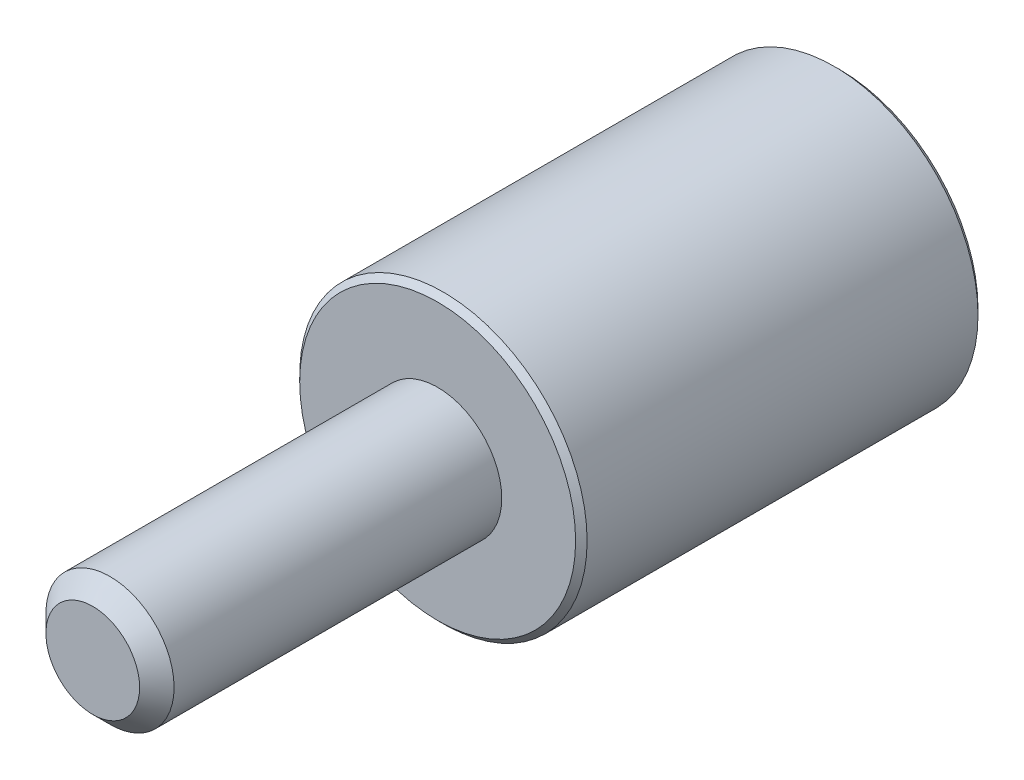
from build123d import *

# Parameters (mm, degrees)
SKETCH1_R           = 12.5
SKETCH1_R_2         = 6.45
BOSS_EXTRUDE1_DEPTH = 30
SKETCH2_R           = 12.5
BOSS_EXTRUDE2_DEPTH = 5
SKETCH3_R           = 5.575
BOSS_EXTRUDE3_DEPTH = 30
CHAMFER1_SIZE       = 1.5
CHAMFER2_SIZE       = 0.5
CHAMFER3_SIZE       = 1


with BuildPart() as part:
    # Sketch1 → Boss-Extrude1 (new body)
    with BuildSketch(Plane.XY):
        Circle(SKETCH1_R)
        Circle(SKETCH1_R_2, mode=Mode.SUBTRACT)
    extrude(amount=BOSS_EXTRUDE1_DEPTH)

    # Sketch2 → Boss-Extrude2 (add)
    with BuildSketch(Plane.XY.offset(30)):
        Circle(SKETCH2_R)
    extrude(amount=BOSS_EXTRUDE2_DEPTH)

    # Sketch3 → Boss-Extrude3 (add)
    with BuildSketch(Plane.XY.offset(35)):
        Circle(SKETCH3_R)
    extrude(amount=BOSS_EXTRUDE3_DEPTH)

    # Chamfer1
    chamfer1_edges = [part.edges().sort_by_distance(p)[0] for p in [
        (-5.575, 0, 65),
    ]]
    chamfer(chamfer1_edges, length=CHAMFER1_SIZE)

    # Chamfer2
    chamfer2_edges = [part.edges().sort_by_distance(p)[0] for p in [
        (-12.5, 0, 0),
        (-12.5, 0, 35),
    ]]
    chamfer(chamfer2_edges, length=CHAMFER2_SIZE)

    # Chamfer3
    chamfer3_edges = [part.edges().sort_by_distance(p)[0] for p in [
        (-6.45, 0, 0),
    ]]
    chamfer(chamfer3_edges, length=CHAMFER3_SIZE)


solid = part.part
